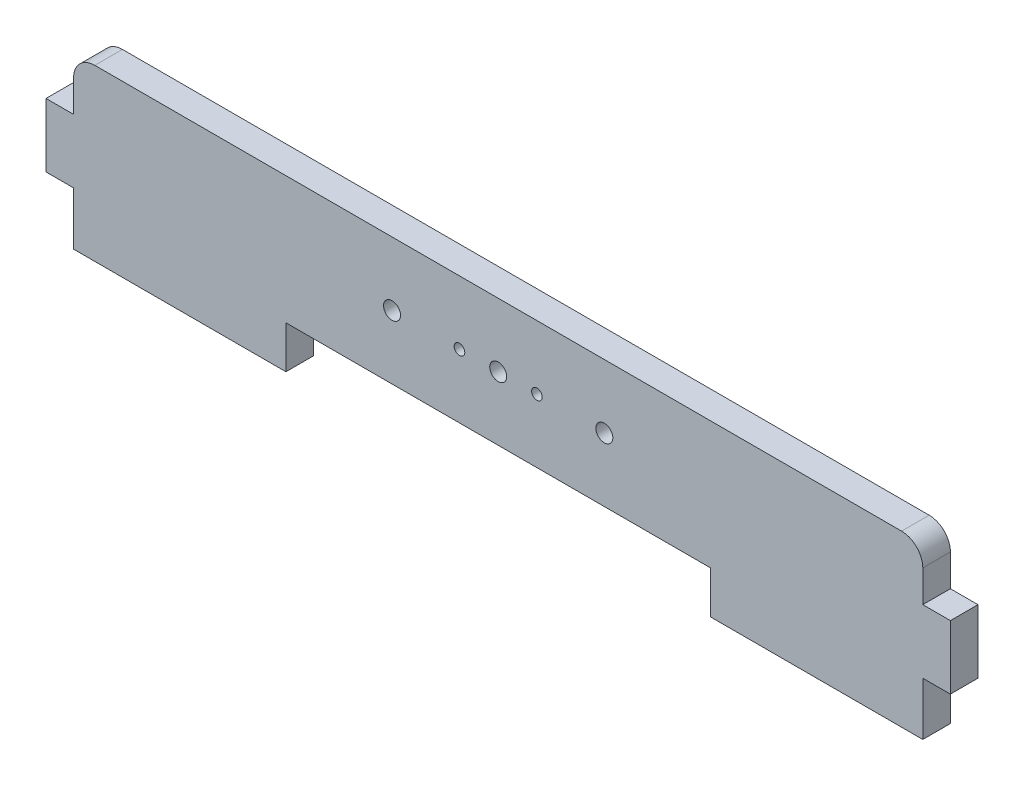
ISO-10303-21;
HEADER;
FILE_DESCRIPTION(('STEP AP214'),'2;1');
FILE_NAME('part.step','',(''),(''),'','','');
FILE_SCHEMA(('AUTOMOTIVE_DESIGN { 1 0 10303 214 1 1 1 1 }'));
ENDSEC;
DATA;
#1=APPLICATION_CONTEXT('core data for automotive mechanical design processes');
#2=APPLICATION_PROTOCOL_DEFINITION('international standard','automotive_design',2000,#1);
#3=PRODUCT_CONTEXT('',#1,'mechanical');
#4=PRODUCT('Part','Part','',(#3));
#5=PRODUCT_RELATED_PRODUCT_CATEGORY('part','',(#4));
#6=PRODUCT_DEFINITION_FORMATION('','',#4);
#7=PRODUCT_DEFINITION_CONTEXT('part definition',#1,'design');
#8=PRODUCT_DEFINITION('design','',#6,#7);
#9=PRODUCT_DEFINITION_SHAPE('','',#8);
#10=(LENGTH_UNIT() NAMED_UNIT(*) SI_UNIT(.MILLI.,.METRE.));
#11=(NAMED_UNIT(*) PLANE_ANGLE_UNIT() SI_UNIT($,.RADIAN.));
#12=(NAMED_UNIT(*) SI_UNIT($,.STERADIAN.) SOLID_ANGLE_UNIT());
#13=UNCERTAINTY_MEASURE_WITH_UNIT(LENGTH_MEASURE(1.E-05),#10,'distance_accuracy_value','');
#14=(GEOMETRIC_REPRESENTATION_CONTEXT(3) GLOBAL_UNCERTAINTY_ASSIGNED_CONTEXT((#13)) GLOBAL_UNIT_ASSIGNED_CONTEXT((#10,
#11,#12)) REPRESENTATION_CONTEXT('',''));
#15=CARTESIAN_POINT('',(0.,0.,0.));
#16=DIRECTION('',(0.,0.,1.));
#17=DIRECTION('',(1.,0.,0.));
#18=AXIS2_PLACEMENT_3D('',#15,#16,#17);
#19=CARTESIAN_POINT('',(200.,15.,13.));
#20=DIRECTION('',(-1.,0.,0.));
#21=DIRECTION('',(0.,0.,1.));
#22=AXIS2_PLACEMENT_3D('',#19,#20,#21);
#23=PLANE('',#22);
#24=DIRECTION('',(0.,1.,0.));
#25=VECTOR('',#24,1.);
#26=CARTESIAN_POINT('',(200.,15.,0.));
#27=LINE('',#26,#25);
#28=CARTESIAN_POINT('',(200.,15.,0.));
#29=VERTEX_POINT('',#28);
#30=CARTESIAN_POINT('',(200.,30.,0.));
#31=VERTEX_POINT('',#30);
#32=EDGE_CURVE('E221',#29,#31,#27,.T.);
#33=ORIENTED_EDGE('',*,*,#32,.T.);
#34=DIRECTION('',(0.,0.,-1.));
#35=VECTOR('',#34,1.);
#36=CARTESIAN_POINT('',(200.,30.,13.));
#37=LINE('',#36,#35);
#38=CARTESIAN_POINT('',(200.,30.,13.));
#39=VERTEX_POINT('',#38);
#40=EDGE_CURVE('E51',#31,#39,#37,.F.);
#41=ORIENTED_EDGE('',*,*,#40,.T.);
#42=DIRECTION('',(0.,1.,0.));
#43=VECTOR('',#42,1.);
#44=CARTESIAN_POINT('',(200.,15.,13.));
#45=LINE('',#44,#43);
#46=CARTESIAN_POINT('',(200.,15.,13.));
#47=VERTEX_POINT('',#46);
#48=EDGE_CURVE('E253',#47,#39,#45,.T.);
#49=ORIENTED_EDGE('',*,*,#48,.F.);
#50=DIRECTION('',(0.,0.,-1.));
#51=VECTOR('',#50,1.);
#52=CARTESIAN_POINT('',(200.,15.,13.));
#53=LINE('',#52,#51);
#54=EDGE_CURVE('E220',#47,#29,#53,.T.);
#55=ORIENTED_EDGE('',*,*,#54,.T.);
#56=EDGE_LOOP('',(#33,#41,#49,#55));
#57=FACE_BOUND('',#56,.T.);
#58=ADVANCED_FACE('F43',(#57),#23,.F.);
#59=CARTESIAN_POINT('',(-200.,40.,13.));
#60=DIRECTION('',(0.,-1.,0.));
#61=DIRECTION('',(0.,0.,-1.));
#62=AXIS2_PLACEMENT_3D('',#59,#60,#61);
#63=PLANE('',#62);
#64=DIRECTION('',(-1.,0.,0.));
#65=VECTOR('',#64,1.);
#66=CARTESIAN_POINT('',(-200.,40.,13.));
#67=LINE('',#66,#65);
#68=CARTESIAN_POINT('',(190.,40.,13.));
#69=VERTEX_POINT('',#68);
#70=CARTESIAN_POINT('',(-190.,40.,13.));
#71=VERTEX_POINT('',#70);
#72=EDGE_CURVE('E178',#69,#71,#67,.T.);
#73=ORIENTED_EDGE('',*,*,#72,.F.);
#74=DIRECTION('',(0.,0.,-1.));
#75=VECTOR('',#74,1.);
#76=CARTESIAN_POINT('',(190.,40.,13.));
#77=LINE('',#76,#75);
#78=CARTESIAN_POINT('',(190.,40.,0.));
#79=VERTEX_POINT('',#78);
#80=EDGE_CURVE('E298',#69,#79,#77,.T.);
#81=ORIENTED_EDGE('',*,*,#80,.T.);
#82=DIRECTION('',(-1.,0.,0.));
#83=VECTOR('',#82,1.);
#84=CARTESIAN_POINT('',(-200.,40.,0.));
#85=LINE('',#84,#83);
#86=CARTESIAN_POINT('',(-190.,40.,0.));
#87=VERTEX_POINT('',#86);
#88=EDGE_CURVE('E223',#79,#87,#85,.T.);
#89=ORIENTED_EDGE('',*,*,#88,.T.);
#90=DIRECTION('',(0.,0.,-1.));
#91=VECTOR('',#90,1.);
#92=CARTESIAN_POINT('',(-190.,40.,13.));
#93=LINE('',#92,#91);
#94=EDGE_CURVE('E294',#87,#71,#93,.F.);
#95=ORIENTED_EDGE('',*,*,#94,.T.);
#96=EDGE_LOOP('',(#73,#81,#89,#95));
#97=FACE_BOUND('',#96,.T.);
#98=ADVANCED_FACE('F304',(#97),#63,.F.);
#99=CARTESIAN_POINT('',(-200.,15.,13.));
#100=DIRECTION('',(1.,0.,0.));
#101=DIRECTION('',(0.,1.,0.));
#102=AXIS2_PLACEMENT_3D('',#99,#100,#101);
#103=PLANE('',#102);
#104=DIRECTION('',(0.,-1.,0.));
#105=VECTOR('',#104,1.);
#106=CARTESIAN_POINT('',(-200.,15.,13.));
#107=LINE('',#106,#105);
#108=CARTESIAN_POINT('',(-200.,29.9999999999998,13.));
#109=VERTEX_POINT('',#108);
#110=CARTESIAN_POINT('',(-200.,15.,13.));
#111=VERTEX_POINT('',#110);
#112=EDGE_CURVE('E167',#109,#111,#107,.T.);
#113=ORIENTED_EDGE('',*,*,#112,.F.);
#114=DIRECTION('',(0.,0.,-1.));
#115=VECTOR('',#114,1.);
#116=CARTESIAN_POINT('',(-200.,29.9999999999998,13.));
#117=LINE('',#116,#115);
#118=CARTESIAN_POINT('',(-200.,29.9999999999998,0.));
#119=VERTEX_POINT('',#118);
#120=EDGE_CURVE('E187',#109,#119,#117,.T.);
#121=ORIENTED_EDGE('',*,*,#120,.T.);
#122=DIRECTION('',(0.,-1.,0.));
#123=VECTOR('',#122,1.);
#124=CARTESIAN_POINT('',(-200.,15.,0.));
#125=LINE('',#124,#123);
#126=CARTESIAN_POINT('',(-200.,15.,0.));
#127=VERTEX_POINT('',#126);
#128=EDGE_CURVE('E184',#119,#127,#125,.T.);
#129=ORIENTED_EDGE('',*,*,#128,.T.);
#130=DIRECTION('',(0.,0.,-1.));
#131=VECTOR('',#130,1.);
#132=CARTESIAN_POINT('',(-200.,15.,13.));
#133=LINE('',#132,#131);
#134=EDGE_CURVE('E181',#111,#127,#133,.T.);
#135=ORIENTED_EDGE('',*,*,#134,.F.);
#136=EDGE_LOOP('',(#113,#121,#129,#135));
#137=FACE_BOUND('',#136,.T.);
#138=ADVANCED_FACE('F182',(#137),#103,.F.);
#139=CARTESIAN_POINT('',(-200.,15.,13.));
#140=DIRECTION('',(0.,-1.,0.));
#141=DIRECTION('',(1.,0.,0.));
#142=AXIS2_PLACEMENT_3D('',#139,#140,#141);
#143=PLANE('',#142);
#144=DIRECTION('',(-1.,0.,0.));
#145=VECTOR('',#144,1.);
#146=CARTESIAN_POINT('',(-200.,15.,0.));
#147=LINE('',#146,#145);
#148=CARTESIAN_POINT('',(-213.,15.,0.));
#149=VERTEX_POINT('',#148);
#150=EDGE_CURVE('E227',#127,#149,#147,.T.);
#151=ORIENTED_EDGE('',*,*,#150,.T.);
#152=DIRECTION('',(0.,0.,-1.));
#153=VECTOR('',#152,1.);
#154=CARTESIAN_POINT('',(-213.,15.,13.));
#155=LINE('',#154,#153);
#156=CARTESIAN_POINT('',(-213.,15.,13.));
#157=VERTEX_POINT('',#156);
#158=EDGE_CURVE('E188',#157,#149,#155,.T.);
#159=ORIENTED_EDGE('',*,*,#158,.F.);
#160=DIRECTION('',(-1.,0.,0.));
#161=VECTOR('',#160,1.);
#162=CARTESIAN_POINT('',(-200.,15.,13.));
#163=LINE('',#162,#161);
#164=EDGE_CURVE('E171',#111,#157,#163,.T.);
#165=ORIENTED_EDGE('',*,*,#164,.F.);
#166=ORIENTED_EDGE('',*,*,#134,.T.);
#167=EDGE_LOOP('',(#151,#159,#165,#166));
#168=FACE_BOUND('',#167,.T.);
#169=ADVANCED_FACE('F190',(#168),#143,.F.);
#170=CARTESIAN_POINT('',(-213.,15.,13.));
#171=DIRECTION('',(1.,0.,0.));
#172=DIRECTION('',(0.,0.,-1.));
#173=AXIS2_PLACEMENT_3D('',#170,#171,#172);
#174=PLANE('',#173);
#175=DIRECTION('',(0.,-1.,0.));
#176=VECTOR('',#175,1.);
#177=CARTESIAN_POINT('',(-213.,15.,0.));
#178=LINE('',#177,#176);
#179=CARTESIAN_POINT('',(-213.,-15.,0.));
#180=VERTEX_POINT('',#179);
#181=EDGE_CURVE('E229',#149,#180,#178,.T.);
#182=ORIENTED_EDGE('',*,*,#181,.T.);
#183=DIRECTION('',(0.,0.,-1.));
#184=VECTOR('',#183,1.);
#185=CARTESIAN_POINT('',(-213.,-15.,13.));
#186=LINE('',#185,#184);
#187=CARTESIAN_POINT('',(-213.,-15.,13.));
#188=VERTEX_POINT('',#187);
#189=EDGE_CURVE('E286',#188,#180,#186,.T.);
#190=ORIENTED_EDGE('',*,*,#189,.F.);
#191=DIRECTION('',(0.,-1.,0.));
#192=VECTOR('',#191,1.);
#193=CARTESIAN_POINT('',(-213.,15.,13.));
#194=LINE('',#193,#192);
#195=EDGE_CURVE('E193',#157,#188,#194,.T.);
#196=ORIENTED_EDGE('',*,*,#195,.F.);
#197=ORIENTED_EDGE('',*,*,#158,.T.);
#198=EDGE_LOOP('',(#182,#190,#196,#197));
#199=FACE_BOUND('',#198,.T.);
#200=ADVANCED_FACE('F331',(#199),#174,.F.);
#201=CARTESIAN_POINT('',(-200.,-15.,13.));
#202=DIRECTION('',(0.,1.,0.));
#203=DIRECTION('',(-1.,0.,0.));
#204=AXIS2_PLACEMENT_3D('',#201,#202,#203);
#205=PLANE('',#204);
#206=DIRECTION('',(1.,0.,0.));
#207=VECTOR('',#206,1.);
#208=CARTESIAN_POINT('',(-200.,-15.,0.));
#209=LINE('',#208,#207);
#210=CARTESIAN_POINT('',(-200.,-15.,0.));
#211=VERTEX_POINT('',#210);
#212=EDGE_CURVE('E231',#180,#211,#209,.T.);
#213=ORIENTED_EDGE('',*,*,#212,.T.);
#214=DIRECTION('',(0.,0.,-1.));
#215=VECTOR('',#214,1.);
#216=CARTESIAN_POINT('',(-200.,-15.,13.));
#217=LINE('',#216,#215);
#218=CARTESIAN_POINT('',(-200.,-15.,13.));
#219=VERTEX_POINT('',#218);
#220=EDGE_CURVE('E283',#219,#211,#217,.T.);
#221=ORIENTED_EDGE('',*,*,#220,.F.);
#222=DIRECTION('',(1.,0.,0.));
#223=VECTOR('',#222,1.);
#224=CARTESIAN_POINT('',(-200.,-15.,13.));
#225=LINE('',#224,#223);
#226=EDGE_CURVE('E195',#188,#219,#225,.T.);
#227=ORIENTED_EDGE('',*,*,#226,.F.);
#228=ORIENTED_EDGE('',*,*,#189,.T.);
#229=EDGE_LOOP('',(#213,#221,#227,#228));
#230=FACE_BOUND('',#229,.T.);
#231=ADVANCED_FACE('F334',(#230),#205,.F.);
#232=CARTESIAN_POINT('',(-200.,-40.,13.));
#233=DIRECTION('',(1.,0.,0.));
#234=DIRECTION('',(0.,1.,0.));
#235=AXIS2_PLACEMENT_3D('',#232,#233,#234);
#236=PLANE('',#235);
#237=DIRECTION('',(0.,-1.,0.));
#238=VECTOR('',#237,1.);
#239=CARTESIAN_POINT('',(-200.,-40.,0.));
#240=LINE('',#239,#238);
#241=CARTESIAN_POINT('',(-200.,-40.,0.));
#242=VERTEX_POINT('',#241);
#243=EDGE_CURVE('E233',#211,#242,#240,.T.);
#244=ORIENTED_EDGE('',*,*,#243,.T.);
#245=DIRECTION('',(0.,0.,-1.));
#246=VECTOR('',#245,1.);
#247=CARTESIAN_POINT('',(-200.,-40.,13.));
#248=LINE('',#247,#246);
#249=CARTESIAN_POINT('',(-200.,-40.,13.));
#250=VERTEX_POINT('',#249);
#251=EDGE_CURVE('E280',#250,#242,#248,.T.);
#252=ORIENTED_EDGE('',*,*,#251,.F.);
#253=DIRECTION('',(0.,-1.,0.));
#254=VECTOR('',#253,1.);
#255=CARTESIAN_POINT('',(-200.,-40.,13.));
#256=LINE('',#255,#254);
#257=EDGE_CURVE('E200',#219,#250,#256,.T.);
#258=ORIENTED_EDGE('',*,*,#257,.F.);
#259=ORIENTED_EDGE('',*,*,#220,.T.);
#260=EDGE_LOOP('',(#244,#252,#258,#259));
#261=FACE_BOUND('',#260,.T.);
#262=ADVANCED_FACE('F338',(#261),#236,.F.);
#263=CARTESIAN_POINT('',(-200.,-40.,13.));
#264=DIRECTION('',(0.,1.,0.));
#265=DIRECTION('',(-1.,0.,0.));
#266=AXIS2_PLACEMENT_3D('',#263,#264,#265);
#267=PLANE('',#266);
#268=DIRECTION('',(1.,0.,0.));
#269=VECTOR('',#268,1.);
#270=CARTESIAN_POINT('',(-200.,-40.,0.));
#271=LINE('',#270,#269);
#272=CARTESIAN_POINT('',(-100.,-40.,0.));
#273=VERTEX_POINT('',#272);
#274=EDGE_CURVE('E235',#242,#273,#271,.T.);
#275=ORIENTED_EDGE('',*,*,#274,.T.);
#276=DIRECTION('',(0.,0.,-1.));
#277=VECTOR('',#276,1.);
#278=CARTESIAN_POINT('',(-100.,-40.,13.));
#279=LINE('',#278,#277);
#280=CARTESIAN_POINT('',(-100.,-40.,13.));
#281=VERTEX_POINT('',#280);
#282=EDGE_CURVE('E277',#281,#273,#279,.T.);
#283=ORIENTED_EDGE('',*,*,#282,.F.);
#284=DIRECTION('',(1.,0.,0.));
#285=VECTOR('',#284,1.);
#286=CARTESIAN_POINT('',(-200.,-40.,13.));
#287=LINE('',#286,#285);
#288=EDGE_CURVE('E202',#250,#281,#287,.T.);
#289=ORIENTED_EDGE('',*,*,#288,.F.);
#290=ORIENTED_EDGE('',*,*,#251,.T.);
#291=EDGE_LOOP('',(#275,#283,#289,#290));
#292=FACE_BOUND('',#291,.T.);
#293=ADVANCED_FACE('F342',(#292),#267,.F.);
#294=CARTESIAN_POINT('',(-100.,-20.,13.));
#295=DIRECTION('',(-1.,0.,0.));
#296=DIRECTION('',(0.,0.,1.));
#297=AXIS2_PLACEMENT_3D('',#294,#295,#296);
#298=PLANE('',#297);
#299=DIRECTION('',(0.,1.,0.));
#300=VECTOR('',#299,1.);
#301=CARTESIAN_POINT('',(-100.,-20.,0.));
#302=LINE('',#301,#300);
#303=CARTESIAN_POINT('',(-100.,-20.,0.));
#304=VERTEX_POINT('',#303);
#305=EDGE_CURVE('E237',#273,#304,#302,.T.);
#306=ORIENTED_EDGE('',*,*,#305,.T.);
#307=DIRECTION('',(0.,0.,-1.));
#308=VECTOR('',#307,1.);
#309=CARTESIAN_POINT('',(-100.,-20.,13.));
#310=LINE('',#309,#308);
#311=CARTESIAN_POINT('',(-100.,-20.,13.));
#312=VERTEX_POINT('',#311);
#313=EDGE_CURVE('E274',#312,#304,#310,.T.);
#314=ORIENTED_EDGE('',*,*,#313,.F.);
#315=DIRECTION('',(0.,1.,0.));
#316=VECTOR('',#315,1.);
#317=CARTESIAN_POINT('',(-100.,-20.,13.));
#318=LINE('',#317,#316);
#319=EDGE_CURVE('E204',#281,#312,#318,.T.);
#320=ORIENTED_EDGE('',*,*,#319,.F.);
#321=ORIENTED_EDGE('',*,*,#282,.T.);
#322=EDGE_LOOP('',(#306,#314,#320,#321));
#323=FACE_BOUND('',#322,.T.);
#324=ADVANCED_FACE('F346',(#323),#298,.F.);
#325=CARTESIAN_POINT('',(-100.,-20.,13.));
#326=DIRECTION('',(0.,1.,0.));
#327=DIRECTION('',(0.,0.,1.));
#328=AXIS2_PLACEMENT_3D('',#325,#326,#327);
#329=PLANE('',#328);
#330=DIRECTION('',(1.,0.,0.));
#331=VECTOR('',#330,1.);
#332=CARTESIAN_POINT('',(-100.,-20.,0.));
#333=LINE('',#332,#331);
#334=CARTESIAN_POINT('',(100.,-20.,0.));
#335=VERTEX_POINT('',#334);
#336=EDGE_CURVE('E239',#304,#335,#333,.T.);
#337=ORIENTED_EDGE('',*,*,#336,.T.);
#338=DIRECTION('',(0.,0.,-1.));
#339=VECTOR('',#338,1.);
#340=CARTESIAN_POINT('',(100.,-20.,13.));
#341=LINE('',#340,#339);
#342=CARTESIAN_POINT('',(100.,-20.,13.));
#343=VERTEX_POINT('',#342);
#344=EDGE_CURVE('E271',#343,#335,#341,.T.);
#345=ORIENTED_EDGE('',*,*,#344,.F.);
#346=DIRECTION('',(1.,0.,0.));
#347=VECTOR('',#346,1.);
#348=CARTESIAN_POINT('',(-100.,-20.,13.));
#349=LINE('',#348,#347);
#350=EDGE_CURVE('E206',#312,#343,#349,.T.);
#351=ORIENTED_EDGE('',*,*,#350,.F.);
#352=ORIENTED_EDGE('',*,*,#313,.T.);
#353=EDGE_LOOP('',(#337,#345,#351,#352));
#354=FACE_BOUND('',#353,.T.);
#355=ADVANCED_FACE('F350',(#354),#329,.F.);
#356=CARTESIAN_POINT('',(100.,-20.,13.));
#357=DIRECTION('',(1.,0.,0.));
#358=DIRECTION('',(0.,0.,-1.));
#359=AXIS2_PLACEMENT_3D('',#356,#357,#358);
#360=PLANE('',#359);
#361=DIRECTION('',(0.,-1.,0.));
#362=VECTOR('',#361,1.);
#363=CARTESIAN_POINT('',(100.,-20.,0.));
#364=LINE('',#363,#362);
#365=CARTESIAN_POINT('',(100.,-40.,0.));
#366=VERTEX_POINT('',#365);
#367=EDGE_CURVE('E241',#335,#366,#364,.T.);
#368=ORIENTED_EDGE('',*,*,#367,.T.);
#369=DIRECTION('',(0.,0.,-1.));
#370=VECTOR('',#369,1.);
#371=CARTESIAN_POINT('',(100.,-40.,13.));
#372=LINE('',#371,#370);
#373=CARTESIAN_POINT('',(100.,-40.,13.));
#374=VERTEX_POINT('',#373);
#375=EDGE_CURVE('E268',#374,#366,#372,.T.);
#376=ORIENTED_EDGE('',*,*,#375,.F.);
#377=DIRECTION('',(0.,-1.,0.));
#378=VECTOR('',#377,1.);
#379=CARTESIAN_POINT('',(100.,-20.,13.));
#380=LINE('',#379,#378);
#381=EDGE_CURVE('E208',#343,#374,#380,.T.);
#382=ORIENTED_EDGE('',*,*,#381,.F.);
#383=ORIENTED_EDGE('',*,*,#344,.T.);
#384=EDGE_LOOP('',(#368,#376,#382,#383));
#385=FACE_BOUND('',#384,.T.);
#386=ADVANCED_FACE('F354',(#385),#360,.F.);
#387=CARTESIAN_POINT('',(100.,-40.,13.));
#388=DIRECTION('',(0.,1.,0.));
#389=DIRECTION('',(-1.,0.,0.));
#390=AXIS2_PLACEMENT_3D('',#387,#388,#389);
#391=PLANE('',#390);
#392=DIRECTION('',(1.,0.,0.));
#393=VECTOR('',#392,1.);
#394=CARTESIAN_POINT('',(100.,-40.,0.));
#395=LINE('',#394,#393);
#396=CARTESIAN_POINT('',(200.,-40.,0.));
#397=VERTEX_POINT('',#396);
#398=EDGE_CURVE('E243',#366,#397,#395,.T.);
#399=ORIENTED_EDGE('',*,*,#398,.T.);
#400=DIRECTION('',(0.,0.,-1.));
#401=VECTOR('',#400,1.);
#402=CARTESIAN_POINT('',(200.,-40.,13.));
#403=LINE('',#402,#401);
#404=CARTESIAN_POINT('',(200.,-40.,13.));
#405=VERTEX_POINT('',#404);
#406=EDGE_CURVE('E265',#405,#397,#403,.T.);
#407=ORIENTED_EDGE('',*,*,#406,.F.);
#408=DIRECTION('',(1.,0.,0.));
#409=VECTOR('',#408,1.);
#410=CARTESIAN_POINT('',(100.,-40.,13.));
#411=LINE('',#410,#409);
#412=EDGE_CURVE('E210',#374,#405,#411,.T.);
#413=ORIENTED_EDGE('',*,*,#412,.F.);
#414=ORIENTED_EDGE('',*,*,#375,.T.);
#415=EDGE_LOOP('',(#399,#407,#413,#414));
#416=FACE_BOUND('',#415,.T.);
#417=ADVANCED_FACE('F358',(#416),#391,.F.);
#418=CARTESIAN_POINT('',(200.,-40.,13.));
#419=DIRECTION('',(-1.,0.,0.));
#420=DIRECTION('',(0.,0.,1.));
#421=AXIS2_PLACEMENT_3D('',#418,#419,#420);
#422=PLANE('',#421);
#423=DIRECTION('',(0.,1.,0.));
#424=VECTOR('',#423,1.);
#425=CARTESIAN_POINT('',(200.,-40.,0.));
#426=LINE('',#425,#424);
#427=CARTESIAN_POINT('',(200.,-15.,0.));
#428=VERTEX_POINT('',#427);
#429=EDGE_CURVE('E245',#397,#428,#426,.T.);
#430=ORIENTED_EDGE('',*,*,#429,.T.);
#431=DIRECTION('',(0.,0.,-1.));
#432=VECTOR('',#431,1.);
#433=CARTESIAN_POINT('',(200.,-15.,13.));
#434=LINE('',#433,#432);
#435=CARTESIAN_POINT('',(200.,-15.,13.));
#436=VERTEX_POINT('',#435);
#437=EDGE_CURVE('E262',#436,#428,#434,.T.);
#438=ORIENTED_EDGE('',*,*,#437,.F.);
#439=DIRECTION('',(0.,1.,0.));
#440=VECTOR('',#439,1.);
#441=CARTESIAN_POINT('',(200.,-40.,13.));
#442=LINE('',#441,#440);
#443=EDGE_CURVE('E212',#405,#436,#442,.T.);
#444=ORIENTED_EDGE('',*,*,#443,.F.);
#445=ORIENTED_EDGE('',*,*,#406,.T.);
#446=EDGE_LOOP('',(#430,#438,#444,#445));
#447=FACE_BOUND('',#446,.T.);
#448=ADVANCED_FACE('F362',(#447),#422,.F.);
#449=CARTESIAN_POINT('',(200.,-15.,13.));
#450=DIRECTION('',(0.,1.,0.));
#451=DIRECTION('',(-1.,0.,0.));
#452=AXIS2_PLACEMENT_3D('',#449,#450,#451);
#453=PLANE('',#452);
#454=DIRECTION('',(1.,0.,0.));
#455=VECTOR('',#454,1.);
#456=CARTESIAN_POINT('',(200.,-15.,0.));
#457=LINE('',#456,#455);
#458=CARTESIAN_POINT('',(213.,-15.,0.));
#459=VERTEX_POINT('',#458);
#460=EDGE_CURVE('E247',#428,#459,#457,.T.);
#461=ORIENTED_EDGE('',*,*,#460,.T.);
#462=DIRECTION('',(0.,0.,-1.));
#463=VECTOR('',#462,1.);
#464=CARTESIAN_POINT('',(213.,-15.,13.));
#465=LINE('',#464,#463);
#466=CARTESIAN_POINT('',(213.,-15.,13.));
#467=VERTEX_POINT('',#466);
#468=EDGE_CURVE('E259',#467,#459,#465,.T.);
#469=ORIENTED_EDGE('',*,*,#468,.F.);
#470=DIRECTION('',(1.,0.,0.));
#471=VECTOR('',#470,1.);
#472=CARTESIAN_POINT('',(200.,-15.,13.));
#473=LINE('',#472,#471);
#474=EDGE_CURVE('E214',#436,#467,#473,.T.);
#475=ORIENTED_EDGE('',*,*,#474,.F.);
#476=ORIENTED_EDGE('',*,*,#437,.T.);
#477=EDGE_LOOP('',(#461,#469,#475,#476));
#478=FACE_BOUND('',#477,.T.);
#479=ADVANCED_FACE('F366',(#478),#453,.F.);
#480=CARTESIAN_POINT('',(213.,15.,13.));
#481=DIRECTION('',(-1.,0.,0.));
#482=DIRECTION('',(0.,0.,1.));
#483=AXIS2_PLACEMENT_3D('',#480,#481,#482);
#484=PLANE('',#483);
#485=DIRECTION('',(0.,1.,0.));
#486=VECTOR('',#485,1.);
#487=CARTESIAN_POINT('',(213.,15.,0.));
#488=LINE('',#487,#486);
#489=CARTESIAN_POINT('',(213.,15.,0.));
#490=VERTEX_POINT('',#489);
#491=EDGE_CURVE('E249',#459,#490,#488,.T.);
#492=ORIENTED_EDGE('',*,*,#491,.T.);
#493=DIRECTION('',(0.,0.,-1.));
#494=VECTOR('',#493,1.);
#495=CARTESIAN_POINT('',(213.,15.,13.));
#496=LINE('',#495,#494);
#497=CARTESIAN_POINT('',(213.,15.,13.));
#498=VERTEX_POINT('',#497);
#499=EDGE_CURVE('E256',#498,#490,#496,.T.);
#500=ORIENTED_EDGE('',*,*,#499,.F.);
#501=DIRECTION('',(0.,1.,0.));
#502=VECTOR('',#501,1.);
#503=CARTESIAN_POINT('',(213.,15.,13.));
#504=LINE('',#503,#502);
#505=EDGE_CURVE('E216',#467,#498,#504,.T.);
#506=ORIENTED_EDGE('',*,*,#505,.F.);
#507=ORIENTED_EDGE('',*,*,#468,.T.);
#508=EDGE_LOOP('',(#492,#500,#506,#507));
#509=FACE_BOUND('',#508,.T.);
#510=ADVANCED_FACE('F370',(#509),#484,.F.);
#511=CARTESIAN_POINT('',(200.,15.,13.));
#512=DIRECTION('',(0.,-1.,0.));
#513=DIRECTION('',(1.,0.,0.));
#514=AXIS2_PLACEMENT_3D('',#511,#512,#513);
#515=PLANE('',#514);
#516=DIRECTION('',(-1.,0.,0.));
#517=VECTOR('',#516,1.);
#518=CARTESIAN_POINT('',(200.,15.,0.));
#519=LINE('',#518,#517);
#520=EDGE_CURVE('E251',#490,#29,#519,.T.);
#521=ORIENTED_EDGE('',*,*,#520,.T.);
#522=ORIENTED_EDGE('',*,*,#54,.F.);
#523=DIRECTION('',(-1.,0.,0.));
#524=VECTOR('',#523,1.);
#525=CARTESIAN_POINT('',(200.,15.,13.));
#526=LINE('',#525,#524);
#527=EDGE_CURVE('E218',#498,#47,#526,.T.);
#528=ORIENTED_EDGE('',*,*,#527,.F.);
#529=ORIENTED_EDGE('',*,*,#499,.T.);
#530=EDGE_LOOP('',(#521,#522,#528,#529));
#531=FACE_BOUND('',#530,.T.);
#532=ADVANCED_FACE('F374',(#531),#515,.F.);
#533=CARTESIAN_POINT('',(0.,0.,13.));
#534=DIRECTION('',(0.,0.,-1.));
#535=DIRECTION('',(-1.,0.,0.));
#536=AXIS2_PLACEMENT_3D('',#533,#534,#535);
#537=PLANE('',#536);
#538=CARTESIAN_POINT('',(0.,10.,13.));
#539=DIRECTION('',(0.,0.,-1.));
#540=DIRECTION('',(-1.,0.,0.));
#541=AXIS2_PLACEMENT_3D('',#538,#539,#540);
#542=CIRCLE('',#541,4.);
#543=CARTESIAN_POINT('',(-4.00000000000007,10.,13.));
#544=VERTEX_POINT('',#543);
#545=EDGE_CURVE('E426',#544,#544,#542,.T.);
#546=ORIENTED_EDGE('',*,*,#545,.T.);
#547=EDGE_LOOP('',(#546));
#548=FACE_BOUND('',#547,.T.);
#549=CARTESIAN_POINT('',(18.25,10.,13.));
#550=DIRECTION('',(0.,0.,-1.));
#551=DIRECTION('',(-1.,0.,0.));
#552=AXIS2_PLACEMENT_3D('',#549,#550,#551);
#553=CIRCLE('',#552,2.5);
#554=CARTESIAN_POINT('',(15.75,10.,13.));
#555=VERTEX_POINT('',#554);
#556=EDGE_CURVE('E409',#555,#555,#553,.T.);
#557=ORIENTED_EDGE('',*,*,#556,.T.);
#558=EDGE_LOOP('',(#557));
#559=FACE_BOUND('',#558,.T.);
#560=CARTESIAN_POINT('',(-50.,10.,13.));
#561=DIRECTION('',(0.,0.,-1.));
#562=DIRECTION('',(-1.,0.,0.));
#563=AXIS2_PLACEMENT_3D('',#560,#561,#562);
#564=CIRCLE('',#563,4.00000000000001);
#565=CARTESIAN_POINT('',(-54.,10.,13.));
#566=VERTEX_POINT('',#565);
#567=EDGE_CURVE('E404',#566,#566,#564,.T.);
#568=ORIENTED_EDGE('',*,*,#567,.T.);
#569=EDGE_LOOP('',(#568));
#570=FACE_BOUND('',#569,.T.);
#571=CARTESIAN_POINT('',(50.,10.,13.));
#572=DIRECTION('',(0.,0.,-1.));
#573=DIRECTION('',(-1.,0.,0.));
#574=AXIS2_PLACEMENT_3D('',#571,#572,#573);
#575=CIRCLE('',#574,4.00000000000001);
#576=CARTESIAN_POINT('',(46.,10.,13.));
#577=VERTEX_POINT('',#576);
#578=EDGE_CURVE('E419',#577,#577,#575,.T.);
#579=ORIENTED_EDGE('',*,*,#578,.T.);
#580=EDGE_LOOP('',(#579));
#581=FACE_BOUND('',#580,.T.);
#582=CARTESIAN_POINT('',(-18.25,10.,13.));
#583=DIRECTION('',(0.,0.,-1.));
#584=DIRECTION('',(-1.,0.,0.));
#585=AXIS2_PLACEMENT_3D('',#582,#583,#584);
#586=CIRCLE('',#585,2.5);
#587=CARTESIAN_POINT('',(-20.75,10.,13.));
#588=VERTEX_POINT('',#587);
#589=EDGE_CURVE('E224',#588,#588,#586,.T.);
#590=ORIENTED_EDGE('',*,*,#589,.T.);
#591=EDGE_LOOP('',(#590));
#592=FACE_BOUND('',#591,.T.);
#593=ORIENTED_EDGE('',*,*,#48,.T.);
#594=CARTESIAN_POINT('',(190.,30.,13.));
#595=DIRECTION('',(0.,0.,-1.));
#596=DIRECTION('',(-1.,0.,0.));
#597=AXIS2_PLACEMENT_3D('',#594,#595,#596);
#598=CIRCLE('',#597,10.);
#599=EDGE_CURVE('E11',#39,#69,#598,.F.);
#600=ORIENTED_EDGE('',*,*,#599,.T.);
#601=ORIENTED_EDGE('',*,*,#72,.T.);
#602=CARTESIAN_POINT('',(-190.,30.,13.));
#603=DIRECTION('',(0.,0.,-1.));
#604=DIRECTION('',(-1.,0.,0.));
#605=AXIS2_PLACEMENT_3D('',#602,#603,#604);
#606=CIRCLE('',#605,10.);
#607=EDGE_CURVE('E174',#71,#109,#606,.F.);
#608=ORIENTED_EDGE('',*,*,#607,.T.);
#609=ORIENTED_EDGE('',*,*,#112,.T.);
#610=ORIENTED_EDGE('',*,*,#164,.T.);
#611=ORIENTED_EDGE('',*,*,#195,.T.);
#612=ORIENTED_EDGE('',*,*,#226,.T.);
#613=ORIENTED_EDGE('',*,*,#257,.T.);
#614=ORIENTED_EDGE('',*,*,#288,.T.);
#615=ORIENTED_EDGE('',*,*,#319,.T.);
#616=ORIENTED_EDGE('',*,*,#350,.T.);
#617=ORIENTED_EDGE('',*,*,#381,.T.);
#618=ORIENTED_EDGE('',*,*,#412,.T.);
#619=ORIENTED_EDGE('',*,*,#443,.T.);
#620=ORIENTED_EDGE('',*,*,#474,.T.);
#621=ORIENTED_EDGE('',*,*,#505,.T.);
#622=ORIENTED_EDGE('',*,*,#527,.T.);
#623=EDGE_LOOP('',(#593,#600,#601,#608,#609,#610,#611,#612,#613,#614,#615,#616,#617,#618,#619,
#620,#621,#622));
#624=FACE_BOUND('',#623,.T.);
#625=ADVANCED_FACE('F169',(#548,#559,#570,#581,#592,#624),#537,.F.);
#626=CARTESIAN_POINT('',(0.,0.,0.));
#627=DIRECTION('',(0.,0.,-1.));
#628=DIRECTION('',(-1.,0.,0.));
#629=AXIS2_PLACEMENT_3D('',#626,#627,#628);
#630=PLANE('',#629);
#631=CARTESIAN_POINT('',(0.,10.,0.));
#632=DIRECTION('',(0.,0.,-1.));
#633=DIRECTION('',(-1.,0.,0.));
#634=AXIS2_PLACEMENT_3D('',#631,#632,#633);
#635=CIRCLE('',#634,4.);
#636=CARTESIAN_POINT('',(-4.00000000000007,10.,0.));
#637=VERTEX_POINT('',#636);
#638=EDGE_CURVE('E422',#637,#637,#635,.T.);
#639=ORIENTED_EDGE('',*,*,#638,.F.);
#640=EDGE_LOOP('',(#639));
#641=FACE_BOUND('',#640,.T.);
#642=CARTESIAN_POINT('',(18.25,10.,0.));
#643=DIRECTION('',(0.,0.,-1.));
#644=DIRECTION('',(-1.,0.,0.));
#645=AXIS2_PLACEMENT_3D('',#642,#643,#644);
#646=CIRCLE('',#645,2.5);
#647=CARTESIAN_POINT('',(15.75,10.,0.));
#648=VERTEX_POINT('',#647);
#649=EDGE_CURVE('E412',#648,#648,#646,.T.);
#650=ORIENTED_EDGE('',*,*,#649,.F.);
#651=EDGE_LOOP('',(#650));
#652=FACE_BOUND('',#651,.T.);
#653=CARTESIAN_POINT('',(-50.,10.,0.));
#654=DIRECTION('',(0.,0.,-1.));
#655=DIRECTION('',(-1.,0.,0.));
#656=AXIS2_PLACEMENT_3D('',#653,#654,#655);
#657=CIRCLE('',#656,4.00000000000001);
#658=CARTESIAN_POINT('',(-54.,10.,0.));
#659=VERTEX_POINT('',#658);
#660=EDGE_CURVE('E407',#659,#659,#657,.T.);
#661=ORIENTED_EDGE('',*,*,#660,.F.);
#662=EDGE_LOOP('',(#661));
#663=FACE_BOUND('',#662,.T.);
#664=CARTESIAN_POINT('',(50.,10.,0.));
#665=DIRECTION('',(0.,0.,-1.));
#666=DIRECTION('',(-1.,0.,0.));
#667=AXIS2_PLACEMENT_3D('',#664,#665,#666);
#668=CIRCLE('',#667,4.00000000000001);
#669=CARTESIAN_POINT('',(46.,10.,0.));
#670=VERTEX_POINT('',#669);
#671=EDGE_CURVE('E414',#670,#670,#668,.T.);
#672=ORIENTED_EDGE('',*,*,#671,.F.);
#673=EDGE_LOOP('',(#672));
#674=FACE_BOUND('',#673,.T.);
#675=CARTESIAN_POINT('',(-18.25,10.,0.));
#676=DIRECTION('',(0.,0.,-1.));
#677=DIRECTION('',(-1.,0.,0.));
#678=AXIS2_PLACEMENT_3D('',#675,#676,#677);
#679=CIRCLE('',#678,2.5);
#680=CARTESIAN_POINT('',(-20.75,10.,0.));
#681=VERTEX_POINT('',#680);
#682=EDGE_CURVE('E425',#681,#681,#679,.T.);
#683=ORIENTED_EDGE('',*,*,#682,.F.);
#684=EDGE_LOOP('',(#683));
#685=FACE_BOUND('',#684,.T.);
#686=ORIENTED_EDGE('',*,*,#88,.F.);
#687=CARTESIAN_POINT('',(190.,30.,0.));
#688=DIRECTION('',(0.,0.,-1.));
#689=DIRECTION('',(-1.,0.,0.));
#690=AXIS2_PLACEMENT_3D('',#687,#688,#689);
#691=CIRCLE('',#690,10.);
#692=EDGE_CURVE('E65',#79,#31,#691,.T.);
#693=ORIENTED_EDGE('',*,*,#692,.T.);
#694=ORIENTED_EDGE('',*,*,#32,.F.);
#695=ORIENTED_EDGE('',*,*,#520,.F.);
#696=ORIENTED_EDGE('',*,*,#491,.F.);
#697=ORIENTED_EDGE('',*,*,#460,.F.);
#698=ORIENTED_EDGE('',*,*,#429,.F.);
#699=ORIENTED_EDGE('',*,*,#398,.F.);
#700=ORIENTED_EDGE('',*,*,#367,.F.);
#701=ORIENTED_EDGE('',*,*,#336,.F.);
#702=ORIENTED_EDGE('',*,*,#305,.F.);
#703=ORIENTED_EDGE('',*,*,#274,.F.);
#704=ORIENTED_EDGE('',*,*,#243,.F.);
#705=ORIENTED_EDGE('',*,*,#212,.F.);
#706=ORIENTED_EDGE('',*,*,#181,.F.);
#707=ORIENTED_EDGE('',*,*,#150,.F.);
#708=ORIENTED_EDGE('',*,*,#128,.F.);
#709=CARTESIAN_POINT('',(-190.,30.,0.));
#710=DIRECTION('',(0.,0.,-1.));
#711=DIRECTION('',(-1.,0.,0.));
#712=AXIS2_PLACEMENT_3D('',#709,#710,#711);
#713=CIRCLE('',#712,10.);
#714=EDGE_CURVE('E291',#119,#87,#713,.T.);
#715=ORIENTED_EDGE('',*,*,#714,.T.);
#716=EDGE_LOOP('',(#686,#693,#694,#695,#696,#697,#698,#699,#700,#701,#702,#703,#704,#705,#706,
#707,#708,#715));
#717=FACE_BOUND('',#716,.T.);
#718=ADVANCED_FACE('F307',(#641,#652,#663,#674,#685,#717),#630,.T.);
#719=CARTESIAN_POINT('',(-18.25,10.,13.));
#720=DIRECTION('',(0.,0.,-1.));
#721=DIRECTION('',(-1.,0.,0.));
#722=AXIS2_PLACEMENT_3D('',#719,#720,#721);
#723=CYLINDRICAL_SURFACE('',#722,2.5);
#724=ORIENTED_EDGE('',*,*,#589,.F.);
#725=EDGE_LOOP('',(#724));
#726=FACE_BOUND('',#725,.T.);
#727=ORIENTED_EDGE('',*,*,#682,.T.);
#728=EDGE_LOOP('',(#727));
#729=FACE_BOUND('',#728,.T.);
#730=ADVANCED_FACE('F381',(#726,#729),#723,.F.);
#731=CARTESIAN_POINT('',(50.,10.,13.));
#732=DIRECTION('',(0.,0.,-1.));
#733=DIRECTION('',(-1.,0.,0.));
#734=AXIS2_PLACEMENT_3D('',#731,#732,#733);
#735=CYLINDRICAL_SURFACE('',#734,4.00000000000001);
#736=ORIENTED_EDGE('',*,*,#578,.F.);
#737=EDGE_LOOP('',(#736));
#738=FACE_BOUND('',#737,.T.);
#739=ORIENTED_EDGE('',*,*,#671,.T.);
#740=EDGE_LOOP('',(#739));
#741=FACE_BOUND('',#740,.T.);
#742=ADVANCED_FACE('F388',(#738,#741),#735,.F.);
#743=CARTESIAN_POINT('',(-50.,10.,13.));
#744=DIRECTION('',(0.,0.,-1.));
#745=DIRECTION('',(-1.,0.,0.));
#746=AXIS2_PLACEMENT_3D('',#743,#744,#745);
#747=CYLINDRICAL_SURFACE('',#746,4.00000000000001);
#748=ORIENTED_EDGE('',*,*,#567,.F.);
#749=EDGE_LOOP('',(#748));
#750=FACE_BOUND('',#749,.T.);
#751=ORIENTED_EDGE('',*,*,#660,.T.);
#752=EDGE_LOOP('',(#751));
#753=FACE_BOUND('',#752,.T.);
#754=ADVANCED_FACE('F391',(#750,#753),#747,.F.);
#755=CARTESIAN_POINT('',(18.25,10.,13.));
#756=DIRECTION('',(0.,0.,-1.));
#757=DIRECTION('',(-1.,0.,0.));
#758=AXIS2_PLACEMENT_3D('',#755,#756,#757);
#759=CYLINDRICAL_SURFACE('',#758,2.5);
#760=ORIENTED_EDGE('',*,*,#556,.F.);
#761=EDGE_LOOP('',(#760));
#762=FACE_BOUND('',#761,.T.);
#763=ORIENTED_EDGE('',*,*,#649,.T.);
#764=EDGE_LOOP('',(#763));
#765=FACE_BOUND('',#764,.T.);
#766=ADVANCED_FACE('F317',(#762,#765),#759,.F.);
#767=CARTESIAN_POINT('',(0.,10.,13.));
#768=DIRECTION('',(0.,0.,-1.));
#769=DIRECTION('',(-1.,0.,0.));
#770=AXIS2_PLACEMENT_3D('',#767,#768,#769);
#771=CYLINDRICAL_SURFACE('',#770,4.);
#772=ORIENTED_EDGE('',*,*,#545,.F.);
#773=EDGE_LOOP('',(#772));
#774=FACE_BOUND('',#773,.T.);
#775=ORIENTED_EDGE('',*,*,#638,.T.);
#776=EDGE_LOOP('',(#775));
#777=FACE_BOUND('',#776,.T.);
#778=ADVANCED_FACE('F312',(#774,#777),#771,.F.);
#779=CARTESIAN_POINT('',(-190.,30.,13.));
#780=DIRECTION('',(0.,0.,-1.));
#781=DIRECTION('',(-1.,0.,0.));
#782=AXIS2_PLACEMENT_3D('',#779,#780,#781);
#783=CYLINDRICAL_SURFACE('',#782,10.);
#784=ORIENTED_EDGE('',*,*,#607,.F.);
#785=ORIENTED_EDGE('',*,*,#94,.F.);
#786=ORIENTED_EDGE('',*,*,#714,.F.);
#787=ORIENTED_EDGE('',*,*,#120,.F.);
#788=EDGE_LOOP('',(#784,#785,#786,#787));
#789=FACE_BOUND('',#788,.T.);
#790=ADVANCED_FACE('F310',(#789),#783,.T.);
#791=CARTESIAN_POINT('',(190.,30.,13.));
#792=DIRECTION('',(0.,0.,-1.));
#793=DIRECTION('',(-1.,0.,0.));
#794=AXIS2_PLACEMENT_3D('',#791,#792,#793);
#795=CYLINDRICAL_SURFACE('',#794,10.);
#796=ORIENTED_EDGE('',*,*,#599,.F.);
#797=ORIENTED_EDGE('',*,*,#40,.F.);
#798=ORIENTED_EDGE('',*,*,#692,.F.);
#799=ORIENTED_EDGE('',*,*,#80,.F.);
#800=EDGE_LOOP('',(#796,#797,#798,#799));
#801=FACE_BOUND('',#800,.T.);
#802=ADVANCED_FACE('F45',(#801),#795,.T.);
#803=CLOSED_SHELL('',(#58,#98,#138,#169,#200,#231,#262,#293,#324,#355,#386,#417,#448,#479,#510,
#532,#625,#718,#730,#742,#754,#766,#778,#790,#802));
#804=MANIFOLD_SOLID_BREP('B2',#803);
#805=ADVANCED_BREP_SHAPE_REPRESENTATION('',(#18,#804),#14);
#806=SHAPE_DEFINITION_REPRESENTATION(#9,#805);
ENDSEC;
END-ISO-10303-21;
